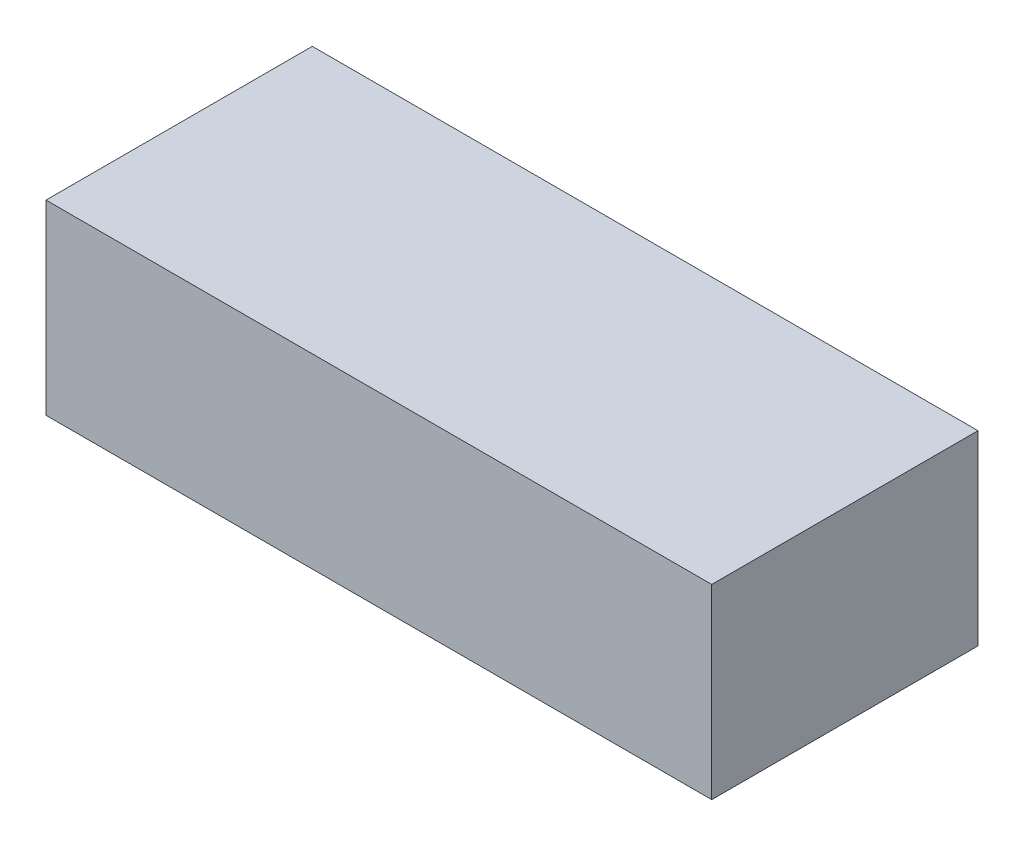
ISO-10303-21;
HEADER;
FILE_DESCRIPTION(('STEP AP214'),'2;1');
FILE_NAME('part.step','',(''),(''),'','','');
FILE_SCHEMA(('AUTOMOTIVE_DESIGN { 1 0 10303 214 1 1 1 1 }'));
ENDSEC;
DATA;
#1=APPLICATION_CONTEXT('core data for automotive mechanical design processes');
#2=APPLICATION_PROTOCOL_DEFINITION('international standard','automotive_design',2000,#1);
#3=PRODUCT_CONTEXT('',#1,'mechanical');
#4=PRODUCT('Part','Part','',(#3));
#5=PRODUCT_RELATED_PRODUCT_CATEGORY('part','',(#4));
#6=PRODUCT_DEFINITION_FORMATION('','',#4);
#7=PRODUCT_DEFINITION_CONTEXT('part definition',#1,'design');
#8=PRODUCT_DEFINITION('design','',#6,#7);
#9=PRODUCT_DEFINITION_SHAPE('','',#8);
#10=(LENGTH_UNIT() NAMED_UNIT(*) SI_UNIT(.MILLI.,.METRE.));
#11=(NAMED_UNIT(*) PLANE_ANGLE_UNIT() SI_UNIT($,.RADIAN.));
#12=(NAMED_UNIT(*) SI_UNIT($,.STERADIAN.) SOLID_ANGLE_UNIT());
#13=UNCERTAINTY_MEASURE_WITH_UNIT(LENGTH_MEASURE(1.E-05),#10,'distance_accuracy_value','');
#14=(GEOMETRIC_REPRESENTATION_CONTEXT(3) GLOBAL_UNCERTAINTY_ASSIGNED_CONTEXT((#13)) GLOBAL_UNIT_ASSIGNED_CONTEXT((#10,
#11,#12)) REPRESENTATION_CONTEXT('',''));
#15=CARTESIAN_POINT('',(0.,0.,0.));
#16=DIRECTION('',(0.,0.,1.));
#17=DIRECTION('',(1.,0.,0.));
#18=AXIS2_PLACEMENT_3D('',#15,#16,#17);
#19=CARTESIAN_POINT('',(62.5,17.5,50.));
#20=DIRECTION('',(-1.,0.,0.));
#21=DIRECTION('',(0.,-1.,0.));
#22=AXIS2_PLACEMENT_3D('',#19,#20,#21);
#23=PLANE('',#22);
#24=DIRECTION('',(0.,1.,0.));
#25=VECTOR('',#24,1.);
#26=CARTESIAN_POINT('',(62.5,17.5,0.));
#27=LINE('',#26,#25);
#28=CARTESIAN_POINT('',(62.5,-17.5,0.));
#29=VERTEX_POINT('',#28);
#30=CARTESIAN_POINT('',(62.5,17.5,0.));
#31=VERTEX_POINT('',#30);
#32=EDGE_CURVE('E98',#29,#31,#27,.T.);
#33=ORIENTED_EDGE('',*,*,#32,.T.);
#34=DIRECTION('',(0.,0.,-1.));
#35=VECTOR('',#34,1.);
#36=CARTESIAN_POINT('',(62.5,17.5,50.));
#37=LINE('',#36,#35);
#38=CARTESIAN_POINT('',(62.5,17.5,50.));
#39=VERTEX_POINT('',#38);
#40=EDGE_CURVE('E11',#39,#31,#37,.T.);
#41=ORIENTED_EDGE('',*,*,#40,.F.);
#42=DIRECTION('',(0.,1.,0.));
#43=VECTOR('',#42,1.);
#44=CARTESIAN_POINT('',(62.5,17.5,50.));
#45=LINE('',#44,#43);
#46=CARTESIAN_POINT('',(62.5,-17.5,50.));
#47=VERTEX_POINT('',#46);
#48=EDGE_CURVE('E86',#47,#39,#45,.T.);
#49=ORIENTED_EDGE('',*,*,#48,.F.);
#50=DIRECTION('',(0.,0.,-1.));
#51=VECTOR('',#50,1.);
#52=CARTESIAN_POINT('',(62.5,-17.5,50.));
#53=LINE('',#52,#51);
#54=EDGE_CURVE('E94',#47,#29,#53,.T.);
#55=ORIENTED_EDGE('',*,*,#54,.T.);
#56=EDGE_LOOP('',(#33,#41,#49,#55));
#57=FACE_BOUND('',#56,.T.);
#58=ADVANCED_FACE('F35',(#57),#23,.F.);
#59=CARTESIAN_POINT('',(-62.5,17.5,50.));
#60=DIRECTION('',(0.,-1.,0.));
#61=DIRECTION('',(0.,0.,-1.));
#62=AXIS2_PLACEMENT_3D('',#59,#60,#61);
#63=PLANE('',#62);
#64=DIRECTION('',(-1.,0.,0.));
#65=VECTOR('',#64,1.);
#66=CARTESIAN_POINT('',(-62.5,17.5,0.));
#67=LINE('',#66,#65);
#68=CARTESIAN_POINT('',(-62.5,17.5,0.));
#69=VERTEX_POINT('',#68);
#70=EDGE_CURVE('E90',#31,#69,#67,.T.);
#71=ORIENTED_EDGE('',*,*,#70,.T.);
#72=DIRECTION('',(0.,0.,-1.));
#73=VECTOR('',#72,1.);
#74=CARTESIAN_POINT('',(-62.5,17.5,50.));
#75=LINE('',#74,#73);
#76=CARTESIAN_POINT('',(-62.5,17.5,50.));
#77=VERTEX_POINT('',#76);
#78=EDGE_CURVE('E43',#77,#69,#75,.T.);
#79=ORIENTED_EDGE('',*,*,#78,.F.);
#80=DIRECTION('',(-1.,0.,0.));
#81=VECTOR('',#80,1.);
#82=CARTESIAN_POINT('',(-62.5,17.5,50.));
#83=LINE('',#82,#81);
#84=EDGE_CURVE('E81',#39,#77,#83,.T.);
#85=ORIENTED_EDGE('',*,*,#84,.F.);
#86=ORIENTED_EDGE('',*,*,#40,.T.);
#87=EDGE_LOOP('',(#71,#79,#85,#86));
#88=FACE_BOUND('',#87,.T.);
#89=ADVANCED_FACE('F89',(#88),#63,.F.);
#90=CARTESIAN_POINT('',(-62.5,17.5,50.));
#91=DIRECTION('',(1.,0.,0.));
#92=DIRECTION('',(0.,1.,0.));
#93=AXIS2_PLACEMENT_3D('',#90,#91,#92);
#94=PLANE('',#93);
#95=DIRECTION('',(0.,-1.,0.));
#96=VECTOR('',#95,1.);
#97=CARTESIAN_POINT('',(-62.5,17.5,0.));
#98=LINE('',#97,#96);
#99=CARTESIAN_POINT('',(-62.5,-17.5,0.));
#100=VERTEX_POINT('',#99);
#101=EDGE_CURVE('E68',#69,#100,#98,.T.);
#102=ORIENTED_EDGE('',*,*,#101,.T.);
#103=DIRECTION('',(0.,0.,-1.));
#104=VECTOR('',#103,1.);
#105=CARTESIAN_POINT('',(-62.5,-17.5,50.));
#106=LINE('',#105,#104);
#107=CARTESIAN_POINT('',(-62.5,-17.5,50.));
#108=VERTEX_POINT('',#107);
#109=EDGE_CURVE('E91',#108,#100,#106,.T.);
#110=ORIENTED_EDGE('',*,*,#109,.F.);
#111=DIRECTION('',(0.,-1.,0.));
#112=VECTOR('',#111,1.);
#113=CARTESIAN_POINT('',(-62.5,17.5,50.));
#114=LINE('',#113,#112);
#115=EDGE_CURVE('E84',#77,#108,#114,.T.);
#116=ORIENTED_EDGE('',*,*,#115,.F.);
#117=ORIENTED_EDGE('',*,*,#78,.T.);
#118=EDGE_LOOP('',(#102,#110,#116,#117));
#119=FACE_BOUND('',#118,.T.);
#120=ADVANCED_FACE('F92',(#119),#94,.F.);
#121=CARTESIAN_POINT('',(-62.5,-17.5,50.));
#122=DIRECTION('',(0.,1.,0.));
#123=DIRECTION('',(0.,0.,1.));
#124=AXIS2_PLACEMENT_3D('',#121,#122,#123);
#125=PLANE('',#124);
#126=DIRECTION('',(1.,0.,0.));
#127=VECTOR('',#126,1.);
#128=CARTESIAN_POINT('',(-62.5,-17.5,0.));
#129=LINE('',#128,#127);
#130=EDGE_CURVE('E74',#100,#29,#129,.T.);
#131=ORIENTED_EDGE('',*,*,#130,.T.);
#132=ORIENTED_EDGE('',*,*,#54,.F.);
#133=DIRECTION('',(1.,0.,0.));
#134=VECTOR('',#133,1.);
#135=CARTESIAN_POINT('',(-62.5,-17.5,50.));
#136=LINE('',#135,#134);
#137=EDGE_CURVE('E51',#108,#47,#136,.T.);
#138=ORIENTED_EDGE('',*,*,#137,.F.);
#139=ORIENTED_EDGE('',*,*,#109,.T.);
#140=EDGE_LOOP('',(#131,#132,#138,#139));
#141=FACE_BOUND('',#140,.T.);
#142=ADVANCED_FACE('F105',(#141),#125,.F.);
#143=CARTESIAN_POINT('',(0.,0.,50.));
#144=DIRECTION('',(0.,0.,1.));
#145=DIRECTION('',(1.,0.,0.));
#146=AXIS2_PLACEMENT_3D('',#143,#144,#145);
#147=PLANE('',#146);
#148=ORIENTED_EDGE('',*,*,#48,.T.);
#149=ORIENTED_EDGE('',*,*,#84,.T.);
#150=ORIENTED_EDGE('',*,*,#115,.T.);
#151=ORIENTED_EDGE('',*,*,#137,.T.);
#152=EDGE_LOOP('',(#148,#149,#150,#151));
#153=FACE_BOUND('',#152,.T.);
#154=ADVANCED_FACE('F82',(#153),#147,.T.);
#155=CARTESIAN_POINT('',(0.,0.,0.));
#156=DIRECTION('',(0.,0.,1.));
#157=DIRECTION('',(1.,0.,0.));
#158=AXIS2_PLACEMENT_3D('',#155,#156,#157);
#159=PLANE('',#158);
#160=ORIENTED_EDGE('',*,*,#32,.F.);
#161=ORIENTED_EDGE('',*,*,#130,.F.);
#162=ORIENTED_EDGE('',*,*,#101,.F.);
#163=ORIENTED_EDGE('',*,*,#70,.F.);
#164=EDGE_LOOP('',(#160,#161,#162,#163));
#165=FACE_BOUND('',#164,.T.);
#166=ADVANCED_FACE('F108',(#165),#159,.F.);
#167=CLOSED_SHELL('',(#58,#89,#120,#142,#154,#166));
#168=MANIFOLD_SOLID_BREP('B2',#167);
#169=ADVANCED_BREP_SHAPE_REPRESENTATION('',(#18,#168),#14);
#170=SHAPE_DEFINITION_REPRESENTATION(#9,#169);
ENDSEC;
END-ISO-10303-21;
